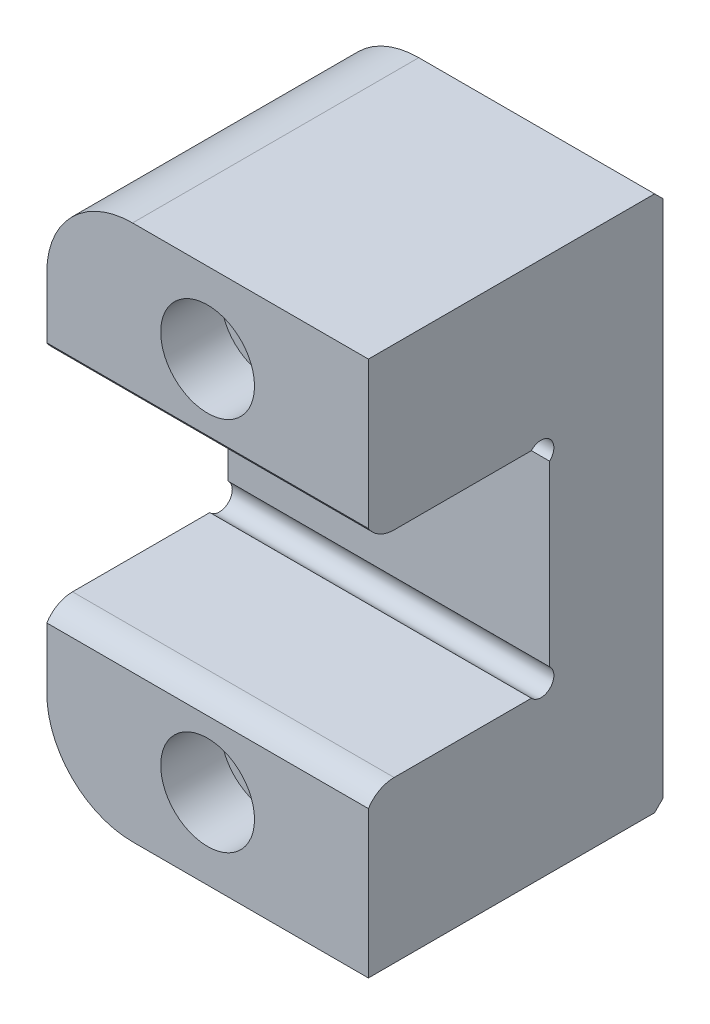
from build123d import *

# Parameters (mm, degrees)
EXTRUDE1_DEPTH             = 19.05
FILLET1_R                  = 10.16
CUT_EXTRUDE1_DEPTH         = 59.716043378
CUT_EXTRUDE2_DEPTH         = 61.658289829
SKETCH6_R                  = 1.524
CUT_EXTRUDE3_DEPTH         = 61.658289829
F_1_4_20_CBORE_D           = 7.14248
F_1_4_20_CBORE_CBORE_D     = 11.1125
F_1_4_20_CBORE_CBORE_DEPTH = 7.14375
CHAMFER3_SIZE              = 3.81
CHAMFER3_SIZE2             = 1.020886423
CHAMFER1_SIZE              = 1.016


with BuildPart() as part:
    # Sketch1 → Extrude1 (new, symmetric)
    with BuildSketch(Plane(origin=(0, 0, 0), x_dir=(0, 0, -1), z_dir=(1, 0, 0))):
        Polygon((0, 12.7), (21.463, 12.7), (21.463, -12.7), (0, -12.7), (0, -31.75), (34.925, -31.75), (34.925, 31.75), (0, 31.75), align=None)
    extrude(amount=EXTRUDE1_DEPTH, both=True)

    # Fillet1
    fillet1_edges = [part.edges().sort_by_distance(p)[0] for p in [
        (-19.05, 31.75, -17.4625),
        (-19.05, -31.75, -17.4625),
    ]]
    fillet(fillet1_edges, radius=FILLET1_R)

    # Sketch2 → Cut-Extrude1 (cut, through all)
    with BuildSketch(Plane(origin=(-15.875, 0, -34.925), x_dir=(1, 0, 0), z_dir=(0, 0, 1))):
        Polygon((-4.7625, 7.266543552), (-4.7625, -7.266543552), (-1.5875, -5.433456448), (-1.5875, 5.433456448), align=None)
    extrude(amount=CUT_EXTRUDE1_DEPTH, mode=Mode.SUBTRACT)

    # Sketch5 → Cut-Extrude2 (cut, through all)
    with BuildSketch(Plane(origin=(19.05, 0, 0), x_dir=(0, 0, -1), z_dir=(1, 0, 0))):
        with BuildLine():
            Line((-3.302, -11.195483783), (3.048, -11.195483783))
            Line((3.048, -11.195483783), (3.048, -12.7))
            ThreePointArc((3.048, -12.7), (1.310126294, -13.14500341), (0, -14.370483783))
            Line((0, -14.370483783), (-3.302, -14.370483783))
            Line((-3.302, -14.370483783), (-3.302, -11.195483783))
        make_face()
        with BuildLine():
            Line((3.048, 11.195483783), (3.048, 12.7))
            ThreePointArc((3.048, 12.7), (1.310126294, 13.14500341), (0, 14.370483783))
            Line((0, 14.370483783), (-3.302, 14.370483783))
            Line((-3.302, 14.370483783), (-3.302, 11.195483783))
            Line((-3.302, 11.195483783), (3.048, 11.195483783))
        make_face()
    extrude(amount=-CUT_EXTRUDE2_DEPTH, mode=Mode.SUBTRACT)

    # Sketch6 → Cut-Extrude3 (cut, through all)
    with BuildSketch(Plane(origin=(19.05, 0, 0), x_dir=(0, 0, -1), z_dir=(1, 0, 0))):
        with Locations((20.447, 11.684)):
            Circle(SKETCH6_R)
        with Locations((20.447, -11.684)):
            Circle(SKETCH6_R)
    extrude(amount=-CUT_EXTRUDE3_DEPTH, mode=Mode.SUBTRACT)

    # 1_4_-20 CBORE (through all)
    with Locations(Plane.XY):
        with Locations((0, 22.225), (0, -22.225)):
            CounterBoreHole(F_1_4_20_CBORE_D / 2, F_1_4_20_CBORE_CBORE_D / 2, F_1_4_20_CBORE_CBORE_DEPTH)

    # Chamfer3
    chamfer3_edges = [part.edges().sort_by_distance(p)[0] for p in [
        (-17.4625, 0, -21.463),
    ]]
    chamfer3_side = [part.faces().sort_by_distance(p)[0] for p in [
        (-17.4625, 0, -28.194),
    ]]
    chamfer(chamfer3_edges, length=CHAMFER3_SIZE, length2=CHAMFER3_SIZE2, reference=chamfer3_side[0])

    # Chamfer1
    chamfer1_edges = [part.edges().sort_by_distance(p)[0] for p in [
        (5.08, 31.75, -34.925),
        (5.08, -31.75, -34.925),
        (-19.05, -13.97, -34.925),
        (-16.074204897, 28.774204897, -34.925),
        (-16.074204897, -28.774204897, -34.925),
        (-19.05, 13.97, -34.925),
    ]]
    chamfer(chamfer1_edges, length=CHAMFER1_SIZE)


solid = part.part
